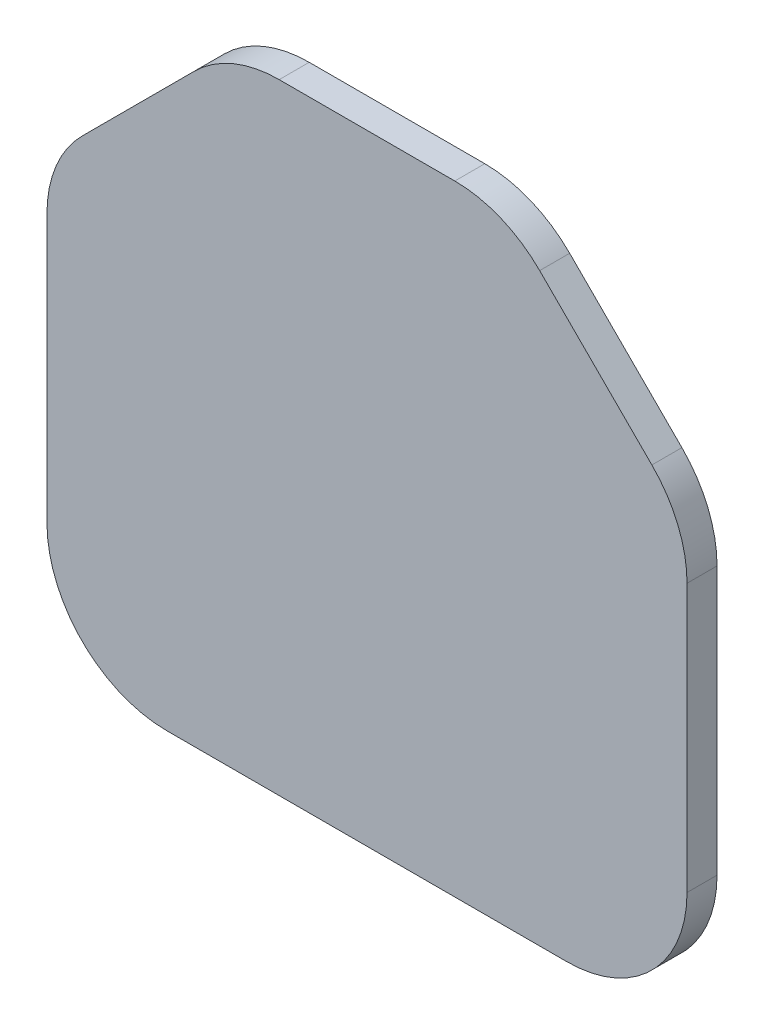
ISO-10303-21;
HEADER;
FILE_DESCRIPTION(('STEP AP214'),'2;1');
FILE_NAME('part.step','',(''),(''),'','','');
FILE_SCHEMA(('AUTOMOTIVE_DESIGN { 1 0 10303 214 1 1 1 1 }'));
ENDSEC;
DATA;
#1=APPLICATION_CONTEXT('core data for automotive mechanical design processes');
#2=APPLICATION_PROTOCOL_DEFINITION('international standard','automotive_design',2000,#1);
#3=PRODUCT_CONTEXT('',#1,'mechanical');
#4=PRODUCT('Part','Part','',(#3));
#5=PRODUCT_RELATED_PRODUCT_CATEGORY('part','',(#4));
#6=PRODUCT_DEFINITION_FORMATION('','',#4);
#7=PRODUCT_DEFINITION_CONTEXT('part definition',#1,'design');
#8=PRODUCT_DEFINITION('design','',#6,#7);
#9=PRODUCT_DEFINITION_SHAPE('','',#8);
#10=(LENGTH_UNIT() NAMED_UNIT(*) SI_UNIT(.MILLI.,.METRE.));
#11=(NAMED_UNIT(*) PLANE_ANGLE_UNIT() SI_UNIT($,.RADIAN.));
#12=(NAMED_UNIT(*) SI_UNIT($,.STERADIAN.) SOLID_ANGLE_UNIT());
#13=UNCERTAINTY_MEASURE_WITH_UNIT(LENGTH_MEASURE(1.E-05),#10,'distance_accuracy_value','');
#14=(GEOMETRIC_REPRESENTATION_CONTEXT(3) GLOBAL_UNCERTAINTY_ASSIGNED_CONTEXT((#13)) GLOBAL_UNIT_ASSIGNED_CONTEXT((#10,
#11,#12)) REPRESENTATION_CONTEXT('',''));
#15=CARTESIAN_POINT('',(0.,0.,0.));
#16=DIRECTION('',(0.,0.,1.));
#17=DIRECTION('',(1.,0.,0.));
#18=AXIS2_PLACEMENT_3D('',#15,#16,#17);
#19=CARTESIAN_POINT('',(20.,9.7794372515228,3.));
#20=DIRECTION('',(0.,0.,-1.));
#21=DIRECTION('',(-1.,0.,0.));
#22=AXIS2_PLACEMENT_3D('',#19,#20,#21);
#23=CYLINDRICAL_SURFACE('',#22,12.);
#24=CARTESIAN_POINT('',(20.,9.7794372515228,0.));
#25=DIRECTION('',(0.,0.,1.));
#26=DIRECTION('',(1.,0.,0.));
#27=AXIS2_PLACEMENT_3D('',#24,#25,#26);
#28=CIRCLE('',#27,12.);
#29=CARTESIAN_POINT('',(32.,9.77943725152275,0.));
#30=VERTEX_POINT('',#29);
#31=CARTESIAN_POINT('',(28.4852813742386,18.2647186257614,0.));
#32=VERTEX_POINT('',#31);
#33=EDGE_CURVE('E151',#30,#32,#28,.T.);
#34=ORIENTED_EDGE('',*,*,#33,.T.);
#35=DIRECTION('',(0.,0.,-1.));
#36=VECTOR('',#35,1.);
#37=CARTESIAN_POINT('',(28.4852813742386,18.2647186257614,3.));
#38=LINE('',#37,#36);
#39=CARTESIAN_POINT('',(28.4852813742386,18.2647186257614,3.));
#40=VERTEX_POINT('',#39);
#41=EDGE_CURVE('E11',#40,#32,#38,.T.);
#42=ORIENTED_EDGE('',*,*,#41,.F.);
#43=CARTESIAN_POINT('',(20.,9.7794372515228,3.));
#44=DIRECTION('',(0.,0.,1.));
#45=DIRECTION('',(1.,0.,0.));
#46=AXIS2_PLACEMENT_3D('',#43,#44,#45);
#47=CIRCLE('',#46,12.);
#48=CARTESIAN_POINT('',(32.,9.77943725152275,3.));
#49=VERTEX_POINT('',#48);
#50=EDGE_CURVE('E173',#49,#40,#47,.T.);
#51=ORIENTED_EDGE('',*,*,#50,.F.);
#52=DIRECTION('',(0.,0.,-1.));
#53=VECTOR('',#52,1.);
#54=CARTESIAN_POINT('',(32.,9.77943725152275,3.));
#55=LINE('',#54,#53);
#56=EDGE_CURVE('E147',#49,#30,#55,.T.);
#57=ORIENTED_EDGE('',*,*,#56,.T.);
#58=EDGE_LOOP('',(#34,#42,#51,#57));
#59=FACE_BOUND('',#58,.T.);
#60=ADVANCED_FACE('F31',(#59),#23,.T.);
#61=CARTESIAN_POINT('',(28.4852813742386,18.2647186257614,3.));
#62=DIRECTION('',(-0.707106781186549,-0.707106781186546,0.));
#63=DIRECTION('',(0.707106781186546,-0.707106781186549,0.));
#64=AXIS2_PLACEMENT_3D('',#61,#62,#63);
#65=PLANE('',#64);
#66=DIRECTION('',(-0.707106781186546,0.707106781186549,0.));
#67=VECTOR('',#66,1.);
#68=CARTESIAN_POINT('',(28.4852813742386,18.2647186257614,0.));
#69=LINE('',#68,#67);
#70=CARTESIAN_POINT('',(17.2647186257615,29.4852813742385,0.));
#71=VERTEX_POINT('',#70);
#72=EDGE_CURVE('E154',#32,#71,#69,.T.);
#73=ORIENTED_EDGE('',*,*,#72,.T.);
#74=DIRECTION('',(0.,0.,-1.));
#75=VECTOR('',#74,1.);
#76=CARTESIAN_POINT('',(17.2647186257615,29.4852813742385,3.));
#77=LINE('',#76,#75);
#78=CARTESIAN_POINT('',(17.2647186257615,29.4852813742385,3.));
#79=VERTEX_POINT('',#78);
#80=EDGE_CURVE('E39',#79,#71,#77,.T.);
#81=ORIENTED_EDGE('',*,*,#80,.F.);
#82=DIRECTION('',(-0.707106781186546,0.707106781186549,0.));
#83=VECTOR('',#82,1.);
#84=CARTESIAN_POINT('',(28.4852813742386,18.2647186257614,3.));
#85=LINE('',#84,#83);
#86=EDGE_CURVE('E102',#40,#79,#85,.T.);
#87=ORIENTED_EDGE('',*,*,#86,.F.);
#88=ORIENTED_EDGE('',*,*,#41,.T.);
#89=EDGE_LOOP('',(#73,#81,#87,#88));
#90=FACE_BOUND('',#89,.T.);
#91=ADVANCED_FACE('F251',(#90),#65,.F.);
#92=CARTESIAN_POINT('',(8.77943725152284,21.,3.));
#93=DIRECTION('',(0.,0.,-1.));
#94=DIRECTION('',(-1.,0.,0.));
#95=AXIS2_PLACEMENT_3D('',#92,#93,#94);
#96=CYLINDRICAL_SURFACE('',#95,12.);
#97=CARTESIAN_POINT('',(8.77943725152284,21.,0.));
#98=DIRECTION('',(0.,0.,1.));
#99=DIRECTION('',(1.,0.,0.));
#100=AXIS2_PLACEMENT_3D('',#97,#98,#99);
#101=CIRCLE('',#100,12.);
#102=CARTESIAN_POINT('',(8.7794372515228,33.,0.));
#103=VERTEX_POINT('',#102);
#104=EDGE_CURVE('E156',#71,#103,#101,.T.);
#105=ORIENTED_EDGE('',*,*,#104,.T.);
#106=DIRECTION('',(0.,0.,-1.));
#107=VECTOR('',#106,1.);
#108=CARTESIAN_POINT('',(8.7794372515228,33.,3.));
#109=LINE('',#108,#107);
#110=CARTESIAN_POINT('',(8.7794372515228,33.,3.));
#111=VERTEX_POINT('',#110);
#112=EDGE_CURVE('E192',#111,#103,#109,.T.);
#113=ORIENTED_EDGE('',*,*,#112,.F.);
#114=CARTESIAN_POINT('',(8.77943725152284,21.,3.));
#115=DIRECTION('',(0.,0.,1.));
#116=DIRECTION('',(1.,0.,0.));
#117=AXIS2_PLACEMENT_3D('',#114,#115,#116);
#118=CIRCLE('',#117,12.);
#119=EDGE_CURVE('E200',#79,#111,#118,.T.);
#120=ORIENTED_EDGE('',*,*,#119,.F.);
#121=ORIENTED_EDGE('',*,*,#80,.T.);
#122=EDGE_LOOP('',(#105,#113,#120,#121));
#123=FACE_BOUND('',#122,.T.);
#124=ADVANCED_FACE('F198',(#123),#96,.T.);
#125=CARTESIAN_POINT('',(8.7794372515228,33.,3.));
#126=DIRECTION('',(0.,-1.,0.));
#127=DIRECTION('',(0.,0.,-1.));
#128=AXIS2_PLACEMENT_3D('',#125,#126,#127);
#129=PLANE('',#128);
#130=DIRECTION('',(-1.,0.,0.));
#131=VECTOR('',#130,1.);
#132=CARTESIAN_POINT('',(8.7794372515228,33.,0.));
#133=LINE('',#132,#131);
#134=CARTESIAN_POINT('',(-8.7794372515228,33.,0.));
#135=VERTEX_POINT('',#134);
#136=EDGE_CURVE('E158',#103,#135,#133,.T.);
#137=ORIENTED_EDGE('',*,*,#136,.T.);
#138=DIRECTION('',(0.,0.,-1.));
#139=VECTOR('',#138,1.);
#140=CARTESIAN_POINT('',(-8.7794372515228,33.,3.));
#141=LINE('',#140,#139);
#142=CARTESIAN_POINT('',(-8.7794372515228,33.,3.));
#143=VERTEX_POINT('',#142);
#144=EDGE_CURVE('E189',#143,#135,#141,.T.);
#145=ORIENTED_EDGE('',*,*,#144,.F.);
#146=DIRECTION('',(-1.,0.,0.));
#147=VECTOR('',#146,1.);
#148=CARTESIAN_POINT('',(8.7794372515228,33.,3.));
#149=LINE('',#148,#147);
#150=EDGE_CURVE('E218',#111,#143,#149,.T.);
#151=ORIENTED_EDGE('',*,*,#150,.F.);
#152=ORIENTED_EDGE('',*,*,#112,.T.);
#153=EDGE_LOOP('',(#137,#145,#151,#152));
#154=FACE_BOUND('',#153,.T.);
#155=ADVANCED_FACE('F209',(#154),#129,.F.);
#156=CARTESIAN_POINT('',(-8.77943725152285,21.,3.));
#157=DIRECTION('',(0.,0.,-1.));
#158=DIRECTION('',(-1.,0.,0.));
#159=AXIS2_PLACEMENT_3D('',#156,#157,#158);
#160=CYLINDRICAL_SURFACE('',#159,12.);
#161=CARTESIAN_POINT('',(-8.77943725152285,21.,0.));
#162=DIRECTION('',(0.,0.,1.));
#163=DIRECTION('',(1.,0.,0.));
#164=AXIS2_PLACEMENT_3D('',#161,#162,#163);
#165=CIRCLE('',#164,12.);
#166=CARTESIAN_POINT('',(-17.2647186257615,29.4852813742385,0.));
#167=VERTEX_POINT('',#166);
#168=EDGE_CURVE('E160',#135,#167,#165,.T.);
#169=ORIENTED_EDGE('',*,*,#168,.T.);
#170=DIRECTION('',(0.,0.,-1.));
#171=VECTOR('',#170,1.);
#172=CARTESIAN_POINT('',(-17.2647186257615,29.4852813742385,3.));
#173=LINE('',#172,#171);
#174=CARTESIAN_POINT('',(-17.2647186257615,29.4852813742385,3.));
#175=VERTEX_POINT('',#174);
#176=EDGE_CURVE('E186',#175,#167,#173,.T.);
#177=ORIENTED_EDGE('',*,*,#176,.F.);
#178=CARTESIAN_POINT('',(-8.77943725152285,21.,3.));
#179=DIRECTION('',(0.,0.,1.));
#180=DIRECTION('',(1.,0.,0.));
#181=AXIS2_PLACEMENT_3D('',#178,#179,#180);
#182=CIRCLE('',#181,12.);
#183=EDGE_CURVE('E215',#143,#175,#182,.T.);
#184=ORIENTED_EDGE('',*,*,#183,.F.);
#185=ORIENTED_EDGE('',*,*,#144,.T.);
#186=EDGE_LOOP('',(#169,#177,#184,#185));
#187=FACE_BOUND('',#186,.T.);
#188=ADVANCED_FACE('F213',(#187),#160,.T.);
#189=CARTESIAN_POINT('',(-17.2647186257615,29.4852813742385,3.));
#190=DIRECTION('',(0.707106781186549,-0.707106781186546,0.));
#191=DIRECTION('',(0.707106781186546,0.707106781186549,0.));
#192=AXIS2_PLACEMENT_3D('',#189,#190,#191);
#193=PLANE('',#192);
#194=DIRECTION('',(-0.707106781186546,-0.707106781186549,0.));
#195=VECTOR('',#194,1.);
#196=CARTESIAN_POINT('',(-17.2647186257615,29.4852813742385,0.));
#197=LINE('',#196,#195);
#198=CARTESIAN_POINT('',(-28.4852813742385,18.2647186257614,0.));
#199=VERTEX_POINT('',#198);
#200=EDGE_CURVE('E162',#167,#199,#197,.T.);
#201=ORIENTED_EDGE('',*,*,#200,.T.);
#202=DIRECTION('',(0.,0.,-1.));
#203=VECTOR('',#202,1.);
#204=CARTESIAN_POINT('',(-28.4852813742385,18.2647186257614,3.));
#205=LINE('',#204,#203);
#206=CARTESIAN_POINT('',(-28.4852813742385,18.2647186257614,3.));
#207=VERTEX_POINT('',#206);
#208=EDGE_CURVE('E183',#207,#199,#205,.T.);
#209=ORIENTED_EDGE('',*,*,#208,.F.);
#210=DIRECTION('',(-0.707106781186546,-0.707106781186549,0.));
#211=VECTOR('',#210,1.);
#212=CARTESIAN_POINT('',(-17.2647186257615,29.4852813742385,3.));
#213=LINE('',#212,#211);
#214=EDGE_CURVE('E217',#175,#207,#213,.T.);
#215=ORIENTED_EDGE('',*,*,#214,.F.);
#216=ORIENTED_EDGE('',*,*,#176,.T.);
#217=EDGE_LOOP('',(#201,#209,#215,#216));
#218=FACE_BOUND('',#217,.T.);
#219=ADVANCED_FACE('F264',(#218),#193,.F.);
#220=CARTESIAN_POINT('',(-20.,9.77943725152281,3.));
#221=DIRECTION('',(0.,0.,-1.));
#222=DIRECTION('',(-1.,0.,0.));
#223=AXIS2_PLACEMENT_3D('',#220,#221,#222);
#224=CYLINDRICAL_SURFACE('',#223,12.);
#225=CARTESIAN_POINT('',(-20.,9.77943725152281,0.));
#226=DIRECTION('',(0.,0.,1.));
#227=DIRECTION('',(-1.,0.,0.));
#228=AXIS2_PLACEMENT_3D('',#225,#226,#227);
#229=CIRCLE('',#228,12.);
#230=CARTESIAN_POINT('',(-32.,9.77943725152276,0.));
#231=VERTEX_POINT('',#230);
#232=EDGE_CURVE('E164',#199,#231,#229,.T.);
#233=ORIENTED_EDGE('',*,*,#232,.T.);
#234=DIRECTION('',(0.,0.,-1.));
#235=VECTOR('',#234,1.);
#236=CARTESIAN_POINT('',(-32.,9.77943725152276,3.));
#237=LINE('',#236,#235);
#238=CARTESIAN_POINT('',(-32.,9.77943725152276,3.));
#239=VERTEX_POINT('',#238);
#240=EDGE_CURVE('E180',#239,#231,#237,.T.);
#241=ORIENTED_EDGE('',*,*,#240,.F.);
#242=CARTESIAN_POINT('',(-20.,9.77943725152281,3.));
#243=DIRECTION('',(0.,0.,1.));
#244=DIRECTION('',(-1.,0.,0.));
#245=AXIS2_PLACEMENT_3D('',#242,#243,#244);
#246=CIRCLE('',#245,12.);
#247=EDGE_CURVE('E220',#207,#239,#246,.T.);
#248=ORIENTED_EDGE('',*,*,#247,.F.);
#249=ORIENTED_EDGE('',*,*,#208,.T.);
#250=EDGE_LOOP('',(#233,#241,#248,#249));
#251=FACE_BOUND('',#250,.T.);
#252=ADVANCED_FACE('F267',(#251),#224,.T.);
#253=CARTESIAN_POINT('',(-32.,9.77943725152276,3.));
#254=DIRECTION('',(1.,0.,0.));
#255=DIRECTION('',(0.,1.,0.));
#256=AXIS2_PLACEMENT_3D('',#253,#254,#255);
#257=PLANE('',#256);
#258=DIRECTION('',(0.,-1.,0.));
#259=VECTOR('',#258,1.);
#260=CARTESIAN_POINT('',(-32.,9.77943725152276,0.));
#261=LINE('',#260,#259);
#262=CARTESIAN_POINT('',(-32.,-16.9999999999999,0.));
#263=VERTEX_POINT('',#262);
#264=EDGE_CURVE('E166',#231,#263,#261,.T.);
#265=ORIENTED_EDGE('',*,*,#264,.T.);
#266=DIRECTION('',(0.,0.,-1.));
#267=VECTOR('',#266,1.);
#268=CARTESIAN_POINT('',(-32.,-16.9999999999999,3.));
#269=LINE('',#268,#267);
#270=CARTESIAN_POINT('',(-32.,-16.9999999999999,3.));
#271=VERTEX_POINT('',#270);
#272=EDGE_CURVE('E177',#271,#263,#269,.T.);
#273=ORIENTED_EDGE('',*,*,#272,.F.);
#274=DIRECTION('',(0.,-1.,0.));
#275=VECTOR('',#274,1.);
#276=CARTESIAN_POINT('',(-32.,9.77943725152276,3.));
#277=LINE('',#276,#275);
#278=EDGE_CURVE('E226',#239,#271,#277,.T.);
#279=ORIENTED_EDGE('',*,*,#278,.F.);
#280=ORIENTED_EDGE('',*,*,#240,.T.);
#281=EDGE_LOOP('',(#265,#273,#279,#280));
#282=FACE_BOUND('',#281,.T.);
#283=ADVANCED_FACE('F232',(#282),#257,.F.);
#284=CARTESIAN_POINT('',(-20.,-17.,3.));
#285=DIRECTION('',(0.,0.,-1.));
#286=DIRECTION('',(-1.,0.,0.));
#287=AXIS2_PLACEMENT_3D('',#284,#285,#286);
#288=CYLINDRICAL_SURFACE('',#287,12.);
#289=CARTESIAN_POINT('',(-20.,-17.,0.));
#290=DIRECTION('',(0.,0.,1.));
#291=DIRECTION('',(1.,0.,0.));
#292=AXIS2_PLACEMENT_3D('',#289,#290,#291);
#293=CIRCLE('',#292,12.);
#294=CARTESIAN_POINT('',(-19.9999999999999,-29.,0.));
#295=VERTEX_POINT('',#294);
#296=EDGE_CURVE('E168',#263,#295,#293,.T.);
#297=ORIENTED_EDGE('',*,*,#296,.T.);
#298=DIRECTION('',(0.,0.,-1.));
#299=VECTOR('',#298,1.);
#300=CARTESIAN_POINT('',(-19.9999999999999,-29.,3.));
#301=LINE('',#300,#299);
#302=CARTESIAN_POINT('',(-19.9999999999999,-29.,3.));
#303=VERTEX_POINT('',#302);
#304=EDGE_CURVE('E142',#303,#295,#301,.T.);
#305=ORIENTED_EDGE('',*,*,#304,.F.);
#306=CARTESIAN_POINT('',(-20.,-17.,3.));
#307=DIRECTION('',(0.,0.,1.));
#308=DIRECTION('',(1.,0.,0.));
#309=AXIS2_PLACEMENT_3D('',#306,#307,#308);
#310=CIRCLE('',#309,12.);
#311=EDGE_CURVE('E133',#271,#303,#310,.T.);
#312=ORIENTED_EDGE('',*,*,#311,.F.);
#313=ORIENTED_EDGE('',*,*,#272,.T.);
#314=EDGE_LOOP('',(#297,#305,#312,#313));
#315=FACE_BOUND('',#314,.T.);
#316=ADVANCED_FACE('F236',(#315),#288,.T.);
#317=CARTESIAN_POINT('',(-19.9999999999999,-29.,3.));
#318=DIRECTION('',(0.,1.,0.));
#319=DIRECTION('',(0.,0.,1.));
#320=AXIS2_PLACEMENT_3D('',#317,#318,#319);
#321=PLANE('',#320);
#322=DIRECTION('',(1.,0.,0.));
#323=VECTOR('',#322,1.);
#324=CARTESIAN_POINT('',(-19.9999999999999,-29.,0.));
#325=LINE('',#324,#323);
#326=CARTESIAN_POINT('',(19.9999999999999,-29.,0.));
#327=VERTEX_POINT('',#326);
#328=EDGE_CURVE('E141',#295,#327,#325,.T.);
#329=ORIENTED_EDGE('',*,*,#328,.T.);
#330=DIRECTION('',(0.,0.,-1.));
#331=VECTOR('',#330,1.);
#332=CARTESIAN_POINT('',(19.9999999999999,-29.,3.));
#333=LINE('',#332,#331);
#334=CARTESIAN_POINT('',(19.9999999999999,-29.,3.));
#335=VERTEX_POINT('',#334);
#336=EDGE_CURVE('E138',#335,#327,#333,.T.);
#337=ORIENTED_EDGE('',*,*,#336,.F.);
#338=DIRECTION('',(1.,0.,0.));
#339=VECTOR('',#338,1.);
#340=CARTESIAN_POINT('',(-19.9999999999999,-29.,3.));
#341=LINE('',#340,#339);
#342=EDGE_CURVE('E127',#303,#335,#341,.T.);
#343=ORIENTED_EDGE('',*,*,#342,.F.);
#344=ORIENTED_EDGE('',*,*,#304,.T.);
#345=EDGE_LOOP('',(#329,#337,#343,#344));
#346=FACE_BOUND('',#345,.T.);
#347=ADVANCED_FACE('F139',(#346),#321,.F.);
#348=CARTESIAN_POINT('',(20.,-17.,3.));
#349=DIRECTION('',(0.,0.,-1.));
#350=DIRECTION('',(-1.,0.,0.));
#351=AXIS2_PLACEMENT_3D('',#348,#349,#350);
#352=CYLINDRICAL_SURFACE('',#351,12.);
#353=CARTESIAN_POINT('',(20.,-17.,0.));
#354=DIRECTION('',(0.,0.,1.));
#355=DIRECTION('',(1.,0.,0.));
#356=AXIS2_PLACEMENT_3D('',#353,#354,#355);
#357=CIRCLE('',#356,12.);
#358=CARTESIAN_POINT('',(32.,-16.9999999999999,0.));
#359=VERTEX_POINT('',#358);
#360=EDGE_CURVE('E88',#327,#359,#357,.T.);
#361=ORIENTED_EDGE('',*,*,#360,.T.);
#362=DIRECTION('',(0.,0.,-1.));
#363=VECTOR('',#362,1.);
#364=CARTESIAN_POINT('',(32.,-16.9999999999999,3.));
#365=LINE('',#364,#363);
#366=CARTESIAN_POINT('',(32.,-16.9999999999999,3.));
#367=VERTEX_POINT('',#366);
#368=EDGE_CURVE('E143',#367,#359,#365,.T.);
#369=ORIENTED_EDGE('',*,*,#368,.F.);
#370=CARTESIAN_POINT('',(20.,-17.,3.));
#371=DIRECTION('',(0.,0.,1.));
#372=DIRECTION('',(1.,0.,0.));
#373=AXIS2_PLACEMENT_3D('',#370,#371,#372);
#374=CIRCLE('',#373,12.);
#375=EDGE_CURVE('E131',#335,#367,#374,.T.);
#376=ORIENTED_EDGE('',*,*,#375,.F.);
#377=ORIENTED_EDGE('',*,*,#336,.T.);
#378=EDGE_LOOP('',(#361,#369,#376,#377));
#379=FACE_BOUND('',#378,.T.);
#380=ADVANCED_FACE('F145',(#379),#352,.T.);
#381=CARTESIAN_POINT('',(32.,-16.9999999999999,3.));
#382=DIRECTION('',(-1.,0.,0.));
#383=DIRECTION('',(0.,0.,1.));
#384=AXIS2_PLACEMENT_3D('',#381,#382,#383);
#385=PLANE('',#384);
#386=DIRECTION('',(0.,1.,0.));
#387=VECTOR('',#386,1.);
#388=CARTESIAN_POINT('',(32.,-16.9999999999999,0.));
#389=LINE('',#388,#387);
#390=EDGE_CURVE('E94',#359,#30,#389,.T.);
#391=ORIENTED_EDGE('',*,*,#390,.T.);
#392=ORIENTED_EDGE('',*,*,#56,.F.);
#393=DIRECTION('',(0.,1.,0.));
#394=VECTOR('',#393,1.);
#395=CARTESIAN_POINT('',(32.,-16.9999999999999,3.));
#396=LINE('',#395,#394);
#397=EDGE_CURVE('E47',#367,#49,#396,.T.);
#398=ORIENTED_EDGE('',*,*,#397,.F.);
#399=ORIENTED_EDGE('',*,*,#368,.T.);
#400=EDGE_LOOP('',(#391,#392,#398,#399));
#401=FACE_BOUND('',#400,.T.);
#402=ADVANCED_FACE('F240',(#401),#385,.F.);
#403=CARTESIAN_POINT('',(20.,9.7794372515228,3.));
#404=DIRECTION('',(0.,0.,1.));
#405=DIRECTION('',(1.,0.,0.));
#406=AXIS2_PLACEMENT_3D('',#403,#404,#405);
#407=PLANE('',#406);
#408=ORIENTED_EDGE('',*,*,#50,.T.);
#409=ORIENTED_EDGE('',*,*,#86,.T.);
#410=ORIENTED_EDGE('',*,*,#119,.T.);
#411=ORIENTED_EDGE('',*,*,#150,.T.);
#412=ORIENTED_EDGE('',*,*,#183,.T.);
#413=ORIENTED_EDGE('',*,*,#214,.T.);
#414=ORIENTED_EDGE('',*,*,#247,.T.);
#415=ORIENTED_EDGE('',*,*,#278,.T.);
#416=ORIENTED_EDGE('',*,*,#311,.T.);
#417=ORIENTED_EDGE('',*,*,#342,.T.);
#418=ORIENTED_EDGE('',*,*,#375,.T.);
#419=ORIENTED_EDGE('',*,*,#397,.T.);
#420=EDGE_LOOP('',(#408,#409,#410,#411,#412,#413,#414,#415,#416,#417,#418,#419));
#421=FACE_BOUND('',#420,.T.);
#422=ADVANCED_FACE('F129',(#421),#407,.T.);
#423=CARTESIAN_POINT('',(20.,9.7794372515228,0.));
#424=DIRECTION('',(0.,0.,1.));
#425=DIRECTION('',(1.,0.,0.));
#426=AXIS2_PLACEMENT_3D('',#423,#424,#425);
#427=PLANE('',#426);
#428=ORIENTED_EDGE('',*,*,#33,.F.);
#429=ORIENTED_EDGE('',*,*,#390,.F.);
#430=ORIENTED_EDGE('',*,*,#360,.F.);
#431=ORIENTED_EDGE('',*,*,#328,.F.);
#432=ORIENTED_EDGE('',*,*,#296,.F.);
#433=ORIENTED_EDGE('',*,*,#264,.F.);
#434=ORIENTED_EDGE('',*,*,#232,.F.);
#435=ORIENTED_EDGE('',*,*,#200,.F.);
#436=ORIENTED_EDGE('',*,*,#168,.F.);
#437=ORIENTED_EDGE('',*,*,#136,.F.);
#438=ORIENTED_EDGE('',*,*,#104,.F.);
#439=ORIENTED_EDGE('',*,*,#72,.F.);
#440=EDGE_LOOP('',(#428,#429,#430,#431,#432,#433,#434,#435,#436,#437,#438,#439));
#441=FACE_BOUND('',#440,.T.);
#442=ADVANCED_FACE('F204',(#441),#427,.F.);
#443=CLOSED_SHELL('',(#60,#91,#124,#155,#188,#219,#252,#283,#316,#347,#380,#402,#422,#442));
#444=MANIFOLD_SOLID_BREP('B2',#443);
#445=ADVANCED_BREP_SHAPE_REPRESENTATION('',(#18,#444),#14);
#446=SHAPE_DEFINITION_REPRESENTATION(#9,#445);
ENDSEC;
END-ISO-10303-21;
